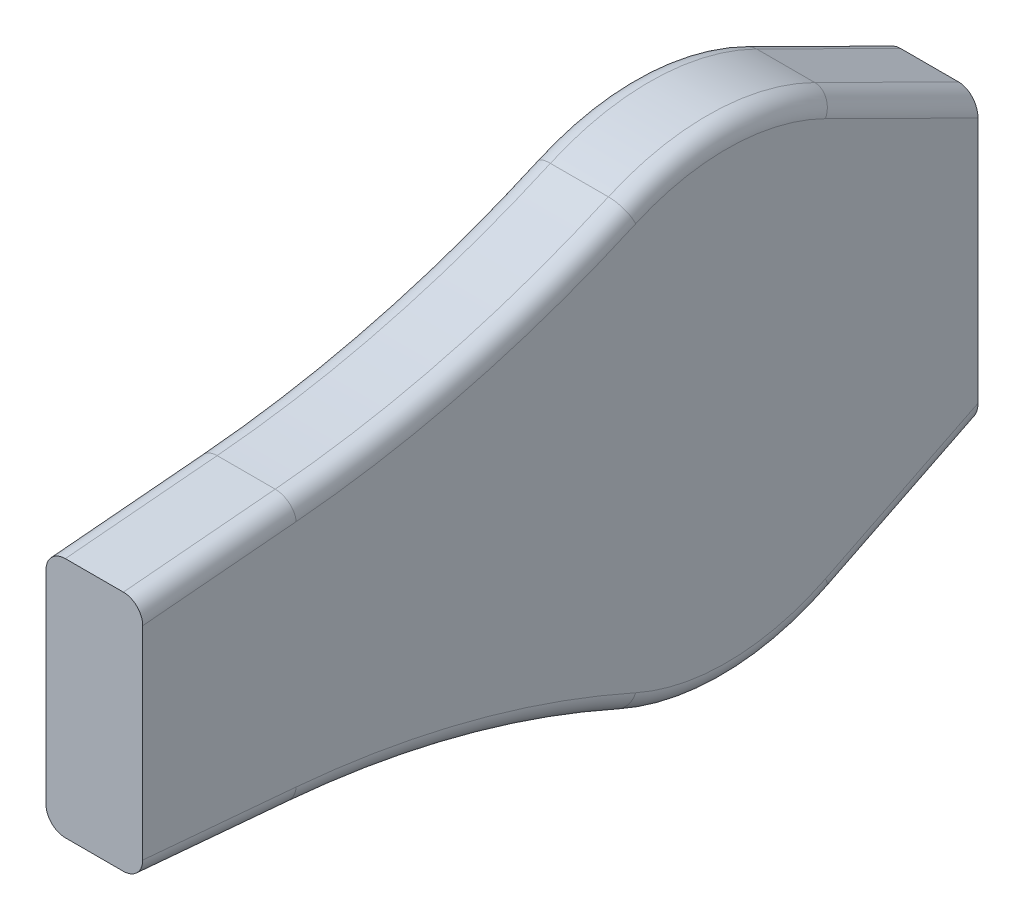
ISO-10303-21;
HEADER;
FILE_DESCRIPTION(('STEP AP214'),'2;1');
FILE_NAME('part.step','',(''),(''),'','','');
FILE_SCHEMA(('AUTOMOTIVE_DESIGN { 1 0 10303 214 1 1 1 1 }'));
ENDSEC;
DATA;
#1=APPLICATION_CONTEXT('core data for automotive mechanical design processes');
#2=APPLICATION_PROTOCOL_DEFINITION('international standard','automotive_design',2000,#1);
#3=PRODUCT_CONTEXT('',#1,'mechanical');
#4=PRODUCT('Part','Part','',(#3));
#5=PRODUCT_RELATED_PRODUCT_CATEGORY('part','',(#4));
#6=PRODUCT_DEFINITION_FORMATION('','',#4);
#7=PRODUCT_DEFINITION_CONTEXT('part definition',#1,'design');
#8=PRODUCT_DEFINITION('design','',#6,#7);
#9=PRODUCT_DEFINITION_SHAPE('','',#8);
#10=(LENGTH_UNIT() NAMED_UNIT(*) SI_UNIT(.MILLI.,.METRE.));
#11=(NAMED_UNIT(*) PLANE_ANGLE_UNIT() SI_UNIT($,.RADIAN.));
#12=(NAMED_UNIT(*) SI_UNIT($,.STERADIAN.) SOLID_ANGLE_UNIT());
#13=UNCERTAINTY_MEASURE_WITH_UNIT(LENGTH_MEASURE(1.E-05),#10,'distance_accuracy_value','');
#14=(GEOMETRIC_REPRESENTATION_CONTEXT(3) GLOBAL_UNCERTAINTY_ASSIGNED_CONTEXT((#13)) GLOBAL_UNIT_ASSIGNED_CONTEXT((#10,
#11,#12)) REPRESENTATION_CONTEXT('',''));
#15=CARTESIAN_POINT('',(0.,0.,0.));
#16=DIRECTION('',(0.,0.,1.));
#17=DIRECTION('',(1.,0.,0.));
#18=AXIS2_PLACEMENT_3D('',#15,#16,#17);
#19=CARTESIAN_POINT('',(1.,6.25,30.18));
#20=DIRECTION('',(0.,-0.996194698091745,-0.087155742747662));
#21=DIRECTION('',(0.,0.087155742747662,-0.996194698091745));
#22=AXIS2_PLACEMENT_3D('',#19,#20,#21);
#23=PLANE('',#22);
#24=DIRECTION('',(-1.,0.,0.));
#25=VECTOR('',#24,1.);
#26=CARTESIAN_POINT('',(1.,6.93667336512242,22.331287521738));
#27=LINE('',#26,#25);
#28=CARTESIAN_POINT('',(0.,6.93667336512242,22.331287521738));
#29=VERTEX_POINT('',#28);
#30=CARTESIAN_POINT('',(-3.,6.93667336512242,22.331287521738));
#31=VERTEX_POINT('',#30);
#32=EDGE_CURVE('E378',#29,#31,#27,.T.);
#33=ORIENTED_EDGE('',*,*,#32,.T.);
#34=DIRECTION('',(0.,-0.087155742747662,0.996194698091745));
#35=VECTOR('',#34,1.);
#36=CARTESIAN_POINT('',(-3.,6.25,30.18));
#37=LINE('',#36,#35);
#38=CARTESIAN_POINT('',(-3.,6.25,30.18));
#39=VERTEX_POINT('',#38);
#40=EDGE_CURVE('E11',#31,#39,#37,.T.);
#41=ORIENTED_EDGE('',*,*,#40,.T.);
#42=DIRECTION('',(-1.,0.,0.));
#43=VECTOR('',#42,1.);
#44=CARTESIAN_POINT('',(1.,6.25,30.18));
#45=LINE('',#44,#43);
#46=CARTESIAN_POINT('',(0.,6.25,30.18));
#47=VERTEX_POINT('',#46);
#48=EDGE_CURVE('E198',#47,#39,#45,.T.);
#49=ORIENTED_EDGE('',*,*,#48,.F.);
#50=DIRECTION('',(0.,-0.087155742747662,0.996194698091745));
#51=VECTOR('',#50,1.);
#52=CARTESIAN_POINT('',(0.,6.25,30.18));
#53=LINE('',#52,#51);
#54=EDGE_CURVE('E55',#47,#29,#53,.F.);
#55=ORIENTED_EDGE('',*,*,#54,.T.);
#56=EDGE_LOOP('',(#33,#41,#49,#55));
#57=FACE_BOUND('',#56,.T.);
#58=ADVANCED_FACE('F45',(#57),#23,.F.);
#59=CARTESIAN_POINT('',(1.,6.25,30.18));
#60=DIRECTION('',(0.,0.,-1.));
#61=DIRECTION('',(-1.,0.,0.));
#62=AXIS2_PLACEMENT_3D('',#59,#60,#61);
#63=PLANE('',#62);
#64=DIRECTION('',(0.,-1.,0.));
#65=VECTOR('',#64,1.);
#66=CARTESIAN_POINT('',(-4.,6.25,30.18));
#67=LINE('',#66,#65);
#68=CARTESIAN_POINT('',(-4.,5.24618016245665,30.18));
#69=VERTEX_POINT('',#68);
#70=CARTESIAN_POINT('',(-4.,-5.24618016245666,30.18));
#71=VERTEX_POINT('',#70);
#72=EDGE_CURVE('E354',#69,#71,#67,.T.);
#73=ORIENTED_EDGE('',*,*,#72,.T.);
#74=CARTESIAN_POINT('',(-3.,-5.24618016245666,30.18));
#75=DIRECTION('',(0.,0.,-1.));
#76=DIRECTION('',(0.,1.,0.));
#77=AXIS2_PLACEMENT_3D('',#74,#75,#76);
#78=ELLIPSE('',#77,1.00381983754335,1.);
#79=CARTESIAN_POINT('',(-3.,-6.25,30.18));
#80=VERTEX_POINT('',#79);
#81=EDGE_CURVE('E338',#71,#80,#78,.F.);
#82=ORIENTED_EDGE('',*,*,#81,.T.);
#83=DIRECTION('',(-1.,0.,0.));
#84=VECTOR('',#83,1.);
#85=CARTESIAN_POINT('',(1.,-6.25,30.18));
#86=LINE('',#85,#84);
#87=CARTESIAN_POINT('',(0.,-6.25,30.18));
#88=VERTEX_POINT('',#87);
#89=EDGE_CURVE('E401',#88,#80,#86,.T.);
#90=ORIENTED_EDGE('',*,*,#89,.F.);
#91=CARTESIAN_POINT('',(0.,-5.24618016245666,30.18));
#92=DIRECTION('',(0.,0.,-1.));
#93=DIRECTION('',(0.,-1.,0.));
#94=AXIS2_PLACEMENT_3D('',#91,#92,#93);
#95=ELLIPSE('',#94,1.00381983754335,1.);
#96=CARTESIAN_POINT('',(1.,-5.24618016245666,30.18));
#97=VERTEX_POINT('',#96);
#98=EDGE_CURVE('E335',#88,#97,#95,.F.);
#99=ORIENTED_EDGE('',*,*,#98,.T.);
#100=DIRECTION('',(0.,-1.,0.));
#101=VECTOR('',#100,1.);
#102=CARTESIAN_POINT('',(1.,6.25,30.18));
#103=LINE('',#102,#101);
#104=CARTESIAN_POINT('',(1.,5.24618016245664,30.18));
#105=VERTEX_POINT('',#104);
#106=EDGE_CURVE('E369',#105,#97,#103,.T.);
#107=ORIENTED_EDGE('',*,*,#106,.F.);
#108=CARTESIAN_POINT('',(0.,5.24618016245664,30.18));
#109=DIRECTION('',(0.,0.,-1.));
#110=DIRECTION('',(0.,-1.,0.));
#111=AXIS2_PLACEMENT_3D('',#108,#109,#110);
#112=ELLIPSE('',#111,1.00381983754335,1.);
#113=EDGE_CURVE('E68',#105,#47,#112,.F.);
#114=ORIENTED_EDGE('',*,*,#113,.T.);
#115=ORIENTED_EDGE('',*,*,#48,.T.);
#116=CARTESIAN_POINT('',(-3.,5.24618016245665,30.18));
#117=DIRECTION('',(0.,0.,-1.));
#118=DIRECTION('',(0.,1.,0.));
#119=AXIS2_PLACEMENT_3D('',#116,#117,#118);
#120=ELLIPSE('',#119,1.00381983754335,1.);
#121=EDGE_CURVE('E332',#39,#69,#120,.F.);
#122=ORIENTED_EDGE('',*,*,#121,.T.);
#123=EDGE_LOOP('',(#73,#82,#90,#99,#107,#114,#115,#122));
#124=FACE_BOUND('',#123,.T.);
#125=ADVANCED_FACE('F465',(#124),#63,.F.);
#126=CARTESIAN_POINT('',(1.,-6.25,30.18));
#127=DIRECTION('',(0.,0.996194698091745,-0.0871557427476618));
#128=DIRECTION('',(0.,0.0871557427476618,0.996194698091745));
#129=AXIS2_PLACEMENT_3D('',#126,#127,#128);
#130=PLANE('',#129);
#131=ORIENTED_EDGE('',*,*,#89,.T.);
#132=DIRECTION('',(0.,-0.0871557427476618,-0.996194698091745));
#133=VECTOR('',#132,1.);
#134=CARTESIAN_POINT('',(-3.,-6.93667336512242,22.331287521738));
#135=LINE('',#134,#133);
#136=CARTESIAN_POINT('',(-3.,-6.93667336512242,22.331287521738));
#137=VERTEX_POINT('',#136);
#138=EDGE_CURVE('E327',#80,#137,#135,.T.);
#139=ORIENTED_EDGE('',*,*,#138,.T.);
#140=DIRECTION('',(-1.,0.,0.));
#141=VECTOR('',#140,1.);
#142=CARTESIAN_POINT('',(1.,-6.93667336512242,22.331287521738));
#143=LINE('',#142,#141);
#144=CARTESIAN_POINT('',(0.,-6.93667336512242,22.331287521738));
#145=VERTEX_POINT('',#144);
#146=EDGE_CURVE('E397',#145,#137,#143,.T.);
#147=ORIENTED_EDGE('',*,*,#146,.F.);
#148=DIRECTION('',(0.,-0.0871557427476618,-0.996194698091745));
#149=VECTOR('',#148,1.);
#150=CARTESIAN_POINT('',(0.,-6.25,30.18));
#151=LINE('',#150,#149);
#152=EDGE_CURVE('E324',#145,#88,#151,.F.);
#153=ORIENTED_EDGE('',*,*,#152,.T.);
#154=EDGE_LOOP('',(#131,#139,#147,#153));
#155=FACE_BOUND('',#154,.T.);
#156=ADVANCED_FACE('F454',(#155),#130,.F.);
#157=CARTESIAN_POINT('',(1.,-60.3298263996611,27.0025831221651));
#158=DIRECTION('',(-1.,0.,0.));
#159=DIRECTION('',(0.,0.,1.));
#160=AXIS2_PLACEMENT_3D('',#157,#158,#159);
#161=CYLINDRICAL_SURFACE('',#160,53.5971062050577);
#162=ORIENTED_EDGE('',*,*,#146,.T.);
#163=CARTESIAN_POINT('',(-3.,-60.3298263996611,27.0025831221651));
#164=DIRECTION('',(-1.,0.,0.));
#165=DIRECTION('',(0.,0.,1.));
#166=AXIS2_PLACEMENT_3D('',#163,#164,#165);
#167=CIRCLE('',#166,53.5971062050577);
#168=CARTESIAN_POINT('',(-3.,-11.409316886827,5.10661220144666));
#169=VERTEX_POINT('',#168);
#170=EDGE_CURVE('E278',#137,#169,#167,.T.);
#171=ORIENTED_EDGE('',*,*,#170,.T.);
#172=DIRECTION('',(-1.,0.,0.));
#173=VECTOR('',#172,1.);
#174=CARTESIAN_POINT('',(1.,-11.409316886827,5.10661220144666));
#175=LINE('',#174,#173);
#176=CARTESIAN_POINT('',(0.,-11.409316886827,5.10661220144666));
#177=VERTEX_POINT('',#176);
#178=EDGE_CURVE('E209',#177,#169,#175,.T.);
#179=ORIENTED_EDGE('',*,*,#178,.F.);
#180=CARTESIAN_POINT('',(0.,-60.3298263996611,27.0025831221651));
#181=DIRECTION('',(-1.,0.,0.));
#182=DIRECTION('',(0.,0.,1.));
#183=AXIS2_PLACEMENT_3D('',#180,#181,#182);
#184=CIRCLE('',#183,53.5971062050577);
#185=EDGE_CURVE('E285',#177,#145,#184,.F.);
#186=ORIENTED_EDGE('',*,*,#185,.T.);
#187=EDGE_LOOP('',(#162,#171,#179,#186));
#188=FACE_BOUND('',#187,.T.);
#189=ADVANCED_FACE('F450',(#188),#161,.F.);
#190=CARTESIAN_POINT('',(1.,0.,0.));
#191=DIRECTION('',(-1.,0.,0.));
#192=DIRECTION('',(0.,0.,1.));
#193=AXIS2_PLACEMENT_3D('',#190,#191,#192);
#194=CYLINDRICAL_SURFACE('',#193,12.5);
#195=ORIENTED_EDGE('',*,*,#178,.T.);
#196=CARTESIAN_POINT('',(-3.,0.,0.));
#197=DIRECTION('',(-1.,0.,0.));
#198=DIRECTION('',(0.,0.,1.));
#199=AXIS2_PLACEMENT_3D('',#196,#197,#198);
#200=CIRCLE('',#199,12.5);
#201=CARTESIAN_POINT('',(-3.,-11.1951226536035,-5.56050616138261));
#202=VERTEX_POINT('',#201);
#203=EDGE_CURVE('E207',#169,#202,#200,.F.);
#204=ORIENTED_EDGE('',*,*,#203,.T.);
#205=DIRECTION('',(-1.,0.,0.));
#206=VECTOR('',#205,1.);
#207=CARTESIAN_POINT('',(1.,-11.1951226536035,-5.56050616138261));
#208=LINE('',#207,#206);
#209=CARTESIAN_POINT('',(0.,-11.1951226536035,-5.56050616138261));
#210=VERTEX_POINT('',#209);
#211=EDGE_CURVE('E190',#210,#202,#208,.T.);
#212=ORIENTED_EDGE('',*,*,#211,.F.);
#213=CARTESIAN_POINT('',(0.,0.,0.));
#214=DIRECTION('',(-1.,0.,0.));
#215=DIRECTION('',(0.,0.,1.));
#216=AXIS2_PLACEMENT_3D('',#213,#214,#215);
#217=CIRCLE('',#216,12.5);
#218=EDGE_CURVE('E204',#210,#177,#217,.T.);
#219=ORIENTED_EDGE('',*,*,#218,.T.);
#220=EDGE_LOOP('',(#195,#204,#212,#219));
#221=FACE_BOUND('',#220,.T.);
#222=ADVANCED_FACE('F203',(#221),#194,.T.);
#223=CARTESIAN_POINT('',(1.,-11.1951226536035,-5.56050616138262));
#224=DIRECTION('',(0.,0.895609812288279,0.444840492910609));
#225=DIRECTION('',(0.,-0.444840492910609,0.895609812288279));
#226=AXIS2_PLACEMENT_3D('',#223,#224,#225);
#227=PLANE('',#226);
#228=ORIENTED_EDGE('',*,*,#211,.T.);
#229=DIRECTION('',(0.,0.444840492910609,-0.895609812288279));
#230=VECTOR('',#229,1.);
#231=CARTESIAN_POINT('',(-3.,-7.5,-13.));
#232=LINE('',#231,#230);
#233=CARTESIAN_POINT('',(-3.,-7.5,-13.));
#234=VERTEX_POINT('',#233);
#235=EDGE_CURVE('E197',#202,#234,#232,.T.);
#236=ORIENTED_EDGE('',*,*,#235,.T.);
#237=DIRECTION('',(-1.,0.,0.));
#238=VECTOR('',#237,1.);
#239=CARTESIAN_POINT('',(1.,-7.5,-13.));
#240=LINE('',#239,#238);
#241=CARTESIAN_POINT('',(0.,-7.5,-13.));
#242=VERTEX_POINT('',#241);
#243=EDGE_CURVE('E193',#242,#234,#240,.T.);
#244=ORIENTED_EDGE('',*,*,#243,.F.);
#245=DIRECTION('',(0.,0.444840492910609,-0.895609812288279));
#246=VECTOR('',#245,1.);
#247=CARTESIAN_POINT('',(0.,-11.1951226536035,-5.56050616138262));
#248=LINE('',#247,#246);
#249=EDGE_CURVE('E186',#242,#210,#248,.F.);
#250=ORIENTED_EDGE('',*,*,#249,.T.);
#251=EDGE_LOOP('',(#228,#236,#244,#250));
#252=FACE_BOUND('',#251,.T.);
#253=ADVANCED_FACE('F188',(#252),#227,.F.);
#254=CARTESIAN_POINT('',(1.,7.5,-13.));
#255=DIRECTION('',(0.,0.,1.));
#256=DIRECTION('',(0.,-1.,0.));
#257=AXIS2_PLACEMENT_3D('',#254,#255,#256);
#258=PLANE('',#257);
#259=ORIENTED_EDGE('',*,*,#243,.T.);
#260=CARTESIAN_POINT('',(-3.,-6.38344233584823,-13.));
#261=DIRECTION('',(0.,0.,1.));
#262=DIRECTION('',(0.,-1.,0.));
#263=AXIS2_PLACEMENT_3D('',#260,#261,#262);
#264=ELLIPSE('',#263,1.11655766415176,1.);
#265=CARTESIAN_POINT('',(-4.,-6.38344233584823,-13.));
#266=VERTEX_POINT('',#265);
#267=EDGE_CURVE('E418',#234,#266,#264,.F.);
#268=ORIENTED_EDGE('',*,*,#267,.T.);
#269=DIRECTION('',(0.,1.,0.));
#270=VECTOR('',#269,1.);
#271=CARTESIAN_POINT('',(-4.,7.5,-13.));
#272=LINE('',#271,#270);
#273=CARTESIAN_POINT('',(-4.,6.38344233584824,-13.));
#274=VERTEX_POINT('',#273);
#275=EDGE_CURVE('E362',#266,#274,#272,.T.);
#276=ORIENTED_EDGE('',*,*,#275,.T.);
#277=CARTESIAN_POINT('',(-3.,6.38344233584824,-13.));
#278=DIRECTION('',(0.,0.,1.));
#279=DIRECTION('',(0.,-1.,0.));
#280=AXIS2_PLACEMENT_3D('',#277,#278,#279);
#281=ELLIPSE('',#280,1.11655766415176,1.);
#282=CARTESIAN_POINT('',(-3.,7.5,-13.));
#283=VERTEX_POINT('',#282);
#284=EDGE_CURVE('E412',#274,#283,#281,.F.);
#285=ORIENTED_EDGE('',*,*,#284,.T.);
#286=DIRECTION('',(-1.,0.,0.));
#287=VECTOR('',#286,1.);
#288=CARTESIAN_POINT('',(1.,7.5,-13.));
#289=LINE('',#288,#287);
#290=CARTESIAN_POINT('',(0.,7.5,-13.));
#291=VERTEX_POINT('',#290);
#292=EDGE_CURVE('E389',#291,#283,#289,.T.);
#293=ORIENTED_EDGE('',*,*,#292,.F.);
#294=CARTESIAN_POINT('',(0.,6.38344233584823,-13.));
#295=DIRECTION('',(0.,0.,1.));
#296=DIRECTION('',(0.,1.,0.));
#297=AXIS2_PLACEMENT_3D('',#294,#295,#296);
#298=ELLIPSE('',#297,1.11655766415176,1.);
#299=CARTESIAN_POINT('',(1.,6.38344233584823,-13.));
#300=VERTEX_POINT('',#299);
#301=EDGE_CURVE('E409',#291,#300,#298,.F.);
#302=ORIENTED_EDGE('',*,*,#301,.T.);
#303=DIRECTION('',(0.,1.,0.));
#304=VECTOR('',#303,1.);
#305=CARTESIAN_POINT('',(1.,7.5,-13.));
#306=LINE('',#305,#304);
#307=CARTESIAN_POINT('',(1.,-6.38344233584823,-13.));
#308=VERTEX_POINT('',#307);
#309=EDGE_CURVE('E374',#308,#300,#306,.T.);
#310=ORIENTED_EDGE('',*,*,#309,.F.);
#311=CARTESIAN_POINT('',(0.,-6.38344233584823,-13.));
#312=DIRECTION('',(0.,0.,1.));
#313=DIRECTION('',(0.,1.,0.));
#314=AXIS2_PLACEMENT_3D('',#311,#312,#313);
#315=ELLIPSE('',#314,1.11655766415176,1.);
#316=EDGE_CURVE('E415',#308,#242,#315,.F.);
#317=ORIENTED_EDGE('',*,*,#316,.T.);
#318=EDGE_LOOP('',(#259,#268,#276,#285,#293,#302,#310,#317));
#319=FACE_BOUND('',#318,.T.);
#320=ADVANCED_FACE('F476',(#319),#258,.F.);
#321=CARTESIAN_POINT('',(1.,11.1951226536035,-5.56050616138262));
#322=DIRECTION('',(0.,-0.895609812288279,0.444840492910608));
#323=DIRECTION('',(0.,-0.444840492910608,-0.89560981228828));
#324=AXIS2_PLACEMENT_3D('',#321,#322,#323);
#325=PLANE('',#324);
#326=ORIENTED_EDGE('',*,*,#292,.T.);
#327=DIRECTION('',(0.,0.444840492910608,0.89560981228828));
#328=VECTOR('',#327,1.);
#329=CARTESIAN_POINT('',(-3.,11.1951226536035,-5.56050616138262));
#330=LINE('',#329,#328);
#331=CARTESIAN_POINT('',(-3.,11.1951226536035,-5.56050616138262));
#332=VERTEX_POINT('',#331);
#333=EDGE_CURVE('E309',#283,#332,#330,.T.);
#334=ORIENTED_EDGE('',*,*,#333,.T.);
#335=DIRECTION('',(-1.,0.,0.));
#336=VECTOR('',#335,1.);
#337=CARTESIAN_POINT('',(1.,11.1951226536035,-5.56050616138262));
#338=LINE('',#337,#336);
#339=CARTESIAN_POINT('',(0.,11.1951226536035,-5.56050616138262));
#340=VERTEX_POINT('',#339);
#341=EDGE_CURVE('E385',#340,#332,#338,.T.);
#342=ORIENTED_EDGE('',*,*,#341,.F.);
#343=DIRECTION('',(0.,0.444840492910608,0.89560981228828));
#344=VECTOR('',#343,1.);
#345=CARTESIAN_POINT('',(0.,11.1951226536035,-5.56050616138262));
#346=LINE('',#345,#344);
#347=EDGE_CURVE('E306',#340,#291,#346,.F.);
#348=ORIENTED_EDGE('',*,*,#347,.T.);
#349=EDGE_LOOP('',(#326,#334,#342,#348));
#350=FACE_BOUND('',#349,.T.);
#351=ADVANCED_FACE('F547',(#350),#325,.F.);
#352=CARTESIAN_POINT('',(1.,0.,0.));
#353=DIRECTION('',(-1.,0.,0.));
#354=DIRECTION('',(0.,0.,1.));
#355=AXIS2_PLACEMENT_3D('',#352,#353,#354);
#356=CYLINDRICAL_SURFACE('',#355,12.5);
#357=ORIENTED_EDGE('',*,*,#341,.T.);
#358=CARTESIAN_POINT('',(-3.,0.,0.));
#359=DIRECTION('',(-1.,0.,0.));
#360=DIRECTION('',(0.,0.,1.));
#361=AXIS2_PLACEMENT_3D('',#358,#359,#360);
#362=CIRCLE('',#361,12.5);
#363=CARTESIAN_POINT('',(-3.,11.409316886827,5.10661220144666));
#364=VERTEX_POINT('',#363);
#365=EDGE_CURVE('E316',#332,#364,#362,.F.);
#366=ORIENTED_EDGE('',*,*,#365,.T.);
#367=DIRECTION('',(-1.,0.,0.));
#368=VECTOR('',#367,1.);
#369=CARTESIAN_POINT('',(1.,11.409316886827,5.10661220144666));
#370=LINE('',#369,#368);
#371=CARTESIAN_POINT('',(0.,11.409316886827,5.10661220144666));
#372=VERTEX_POINT('',#371);
#373=EDGE_CURVE('E381',#372,#364,#370,.T.);
#374=ORIENTED_EDGE('',*,*,#373,.F.);
#375=CARTESIAN_POINT('',(0.,0.,0.));
#376=DIRECTION('',(-1.,0.,0.));
#377=DIRECTION('',(0.,0.,1.));
#378=AXIS2_PLACEMENT_3D('',#375,#376,#377);
#379=CIRCLE('',#378,12.5);
#380=EDGE_CURVE('E313',#372,#340,#379,.T.);
#381=ORIENTED_EDGE('',*,*,#380,.T.);
#382=EDGE_LOOP('',(#357,#366,#374,#381));
#383=FACE_BOUND('',#382,.T.);
#384=ADVANCED_FACE('F549',(#383),#356,.T.);
#385=CARTESIAN_POINT('',(1.,60.3298263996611,27.0025831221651));
#386=DIRECTION('',(-1.,0.,0.));
#387=DIRECTION('',(0.,0.,1.));
#388=AXIS2_PLACEMENT_3D('',#385,#386,#387);
#389=CYLINDRICAL_SURFACE('',#388,53.5971062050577);
#390=ORIENTED_EDGE('',*,*,#373,.T.);
#391=CARTESIAN_POINT('',(-3.,60.3298263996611,27.0025831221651));
#392=DIRECTION('',(-1.,0.,0.));
#393=DIRECTION('',(0.,0.,1.));
#394=AXIS2_PLACEMENT_3D('',#391,#392,#393);
#395=CIRCLE('',#394,53.5971062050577);
#396=EDGE_CURVE('E321',#364,#31,#395,.T.);
#397=ORIENTED_EDGE('',*,*,#396,.T.);
#398=ORIENTED_EDGE('',*,*,#32,.F.);
#399=CARTESIAN_POINT('',(0.,60.3298263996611,27.0025831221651));
#400=DIRECTION('',(-1.,0.,0.));
#401=DIRECTION('',(0.,0.,1.));
#402=AXIS2_PLACEMENT_3D('',#399,#400,#401);
#403=CIRCLE('',#402,53.5971062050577);
#404=EDGE_CURVE('E270',#29,#372,#403,.F.);
#405=ORIENTED_EDGE('',*,*,#404,.T.);
#406=EDGE_LOOP('',(#390,#397,#398,#405));
#407=FACE_BOUND('',#406,.T.);
#408=ADVANCED_FACE('F553',(#407),#389,.F.);
#409=CARTESIAN_POINT('',(1.,60.3298263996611,27.0025831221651));
#410=DIRECTION('',(-1.,0.,0.));
#411=DIRECTION('',(0.,0.,1.));
#412=AXIS2_PLACEMENT_3D('',#409,#410,#411);
#413=PLANE('',#412);
#414=CARTESIAN_POINT('',(1.,0.,0.));
#415=DIRECTION('',(-1.,0.,0.));
#416=DIRECTION('',(0.,0.,1.));
#417=AXIS2_PLACEMENT_3D('',#414,#415,#416);
#418=CIRCLE('',#417,11.5);
#419=CARTESIAN_POINT('',(1.,-10.4965715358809,4.69808322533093));
#420=VERTEX_POINT('',#419);
#421=CARTESIAN_POINT('',(1.,-10.2995128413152,-5.115665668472));
#422=VERTEX_POINT('',#421);
#423=EDGE_CURVE('E301',#420,#422,#418,.F.);
#424=ORIENTED_EDGE('',*,*,#423,.T.);
#425=DIRECTION('',(0.,0.444840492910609,-0.895609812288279));
#426=VECTOR('',#425,1.);
#427=CARTESIAN_POINT('',(1.,-9.11918583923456,-7.49205105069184));
#428=LINE('',#427,#426);
#429=EDGE_CURVE('E225',#422,#308,#428,.T.);
#430=ORIENTED_EDGE('',*,*,#429,.T.);
#431=ORIENTED_EDGE('',*,*,#309,.T.);
#432=DIRECTION('',(0.,0.444840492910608,0.89560981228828));
#433=VECTOR('',#432,1.);
#434=CARTESIAN_POINT('',(1.,32.9956876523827,40.5791781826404));
#435=LINE('',#434,#433);
#436=CARTESIAN_POINT('',(1.,10.2995128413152,-5.11566566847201));
#437=VERTEX_POINT('',#436);
#438=EDGE_CURVE('E291',#300,#437,#435,.T.);
#439=ORIENTED_EDGE('',*,*,#438,.T.);
#440=CARTESIAN_POINT('',(1.,0.,0.));
#441=DIRECTION('',(-1.,0.,0.));
#442=DIRECTION('',(0.,0.,1.));
#443=AXIS2_PLACEMENT_3D('',#440,#441,#442);
#444=CIRCLE('',#443,11.5);
#445=CARTESIAN_POINT('',(1.,10.4965715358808,4.69808322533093));
#446=VERTEX_POINT('',#445);
#447=EDGE_CURVE('E283',#437,#446,#444,.F.);
#448=ORIENTED_EDGE('',*,*,#447,.T.);
#449=CARTESIAN_POINT('',(1.,60.3298263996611,27.0025831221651));
#450=DIRECTION('',(-1.,0.,0.));
#451=DIRECTION('',(0.,0.,1.));
#452=AXIS2_PLACEMENT_3D('',#449,#450,#451);
#453=CIRCLE('',#452,54.5971062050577);
#454=CARTESIAN_POINT('',(1.,5.94047866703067,22.2441317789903));
#455=VERTEX_POINT('',#454);
#456=EDGE_CURVE('E269',#446,#455,#453,.T.);
#457=ORIENTED_EDGE('',*,*,#456,.T.);
#458=DIRECTION('',(0.,-0.087155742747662,0.996194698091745));
#459=VECTOR('',#458,1.);
#460=CARTESIAN_POINT('',(1.,5.94047866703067,22.2441317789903));
#461=LINE('',#460,#459);
#462=EDGE_CURVE('E274',#455,#105,#461,.T.);
#463=ORIENTED_EDGE('',*,*,#462,.T.);
#464=ORIENTED_EDGE('',*,*,#106,.T.);
#465=DIRECTION('',(0.,-0.0871557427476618,-0.996194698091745));
#466=VECTOR('',#465,1.);
#467=CARTESIAN_POINT('',(1.,-5.02393304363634,32.7202961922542));
#468=LINE('',#467,#466);
#469=CARTESIAN_POINT('',(1.,-5.94047866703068,22.2441317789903));
#470=VERTEX_POINT('',#469);
#471=EDGE_CURVE('E295',#97,#470,#468,.T.);
#472=ORIENTED_EDGE('',*,*,#471,.T.);
#473=CARTESIAN_POINT('',(1.,-60.3298263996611,27.0025831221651));
#474=DIRECTION('',(-1.,0.,0.));
#475=DIRECTION('',(0.,0.,1.));
#476=AXIS2_PLACEMENT_3D('',#473,#474,#475);
#477=CIRCLE('',#476,54.5971062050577);
#478=EDGE_CURVE('E298',#470,#420,#477,.T.);
#479=ORIENTED_EDGE('',*,*,#478,.T.);
#480=EDGE_LOOP('',(#424,#430,#431,#439,#448,#457,#463,#464,#472,#479));
#481=FACE_BOUND('',#480,.T.);
#482=ADVANCED_FACE('F464',(#481),#413,.F.);
#483=CARTESIAN_POINT('',(-4.,60.3298263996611,27.0025831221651));
#484=DIRECTION('',(-1.,0.,0.));
#485=DIRECTION('',(0.,0.,1.));
#486=AXIS2_PLACEMENT_3D('',#483,#484,#485);
#487=PLANE('',#486);
#488=ORIENTED_EDGE('',*,*,#275,.F.);
#489=DIRECTION('',(0.,0.444840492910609,-0.895609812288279));
#490=VECTOR('',#489,1.);
#491=CARTESIAN_POINT('',(-4.,-10.2995128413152,-5.115665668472));
#492=LINE('',#491,#490);
#493=CARTESIAN_POINT('',(-4.,-10.2995128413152,-5.115665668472));
#494=VERTEX_POINT('',#493);
#495=EDGE_CURVE('E221',#266,#494,#492,.F.);
#496=ORIENTED_EDGE('',*,*,#495,.T.);
#497=CARTESIAN_POINT('',(-4.,0.,0.));
#498=DIRECTION('',(-1.,0.,0.));
#499=DIRECTION('',(0.,0.,1.));
#500=AXIS2_PLACEMENT_3D('',#497,#498,#499);
#501=CIRCLE('',#500,11.5);
#502=CARTESIAN_POINT('',(-4.,-10.4965715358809,4.69808322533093));
#503=VERTEX_POINT('',#502);
#504=EDGE_CURVE('E439',#494,#503,#501,.T.);
#505=ORIENTED_EDGE('',*,*,#504,.T.);
#506=CARTESIAN_POINT('',(-4.,-60.3298263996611,27.0025831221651));
#507=DIRECTION('',(-1.,0.,0.));
#508=DIRECTION('',(0.,0.,1.));
#509=AXIS2_PLACEMENT_3D('',#506,#507,#508);
#510=CIRCLE('',#509,54.5971062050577);
#511=CARTESIAN_POINT('',(-4.,-5.94047866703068,22.2441317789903));
#512=VERTEX_POINT('',#511);
#513=EDGE_CURVE('E436',#503,#512,#510,.F.);
#514=ORIENTED_EDGE('',*,*,#513,.T.);
#515=DIRECTION('',(0.,-0.0871557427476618,-0.996194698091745));
#516=VECTOR('',#515,1.);
#517=CARTESIAN_POINT('',(-4.,-5.25380530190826,30.0928442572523));
#518=LINE('',#517,#516);
#519=EDGE_CURVE('E433',#512,#71,#518,.F.);
#520=ORIENTED_EDGE('',*,*,#519,.T.);
#521=ORIENTED_EDGE('',*,*,#72,.F.);
#522=DIRECTION('',(0.,-0.087155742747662,0.996194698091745));
#523=VECTOR('',#522,1.);
#524=CARTESIAN_POINT('',(-4.,5.94047866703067,22.2441317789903));
#525=LINE('',#524,#523);
#526=CARTESIAN_POINT('',(-4.,5.94047866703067,22.2441317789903));
#527=VERTEX_POINT('',#526);
#528=EDGE_CURVE('E421',#69,#527,#525,.F.);
#529=ORIENTED_EDGE('',*,*,#528,.T.);
#530=CARTESIAN_POINT('',(-4.,60.3298263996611,27.0025831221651));
#531=DIRECTION('',(-1.,0.,0.));
#532=DIRECTION('',(0.,0.,1.));
#533=AXIS2_PLACEMENT_3D('',#530,#531,#532);
#534=CIRCLE('',#533,54.5971062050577);
#535=CARTESIAN_POINT('',(-4.,10.4965715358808,4.69808322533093));
#536=VERTEX_POINT('',#535);
#537=EDGE_CURVE('E424',#527,#536,#534,.F.);
#538=ORIENTED_EDGE('',*,*,#537,.T.);
#539=CARTESIAN_POINT('',(-4.,0.,0.));
#540=DIRECTION('',(-1.,0.,0.));
#541=DIRECTION('',(0.,0.,1.));
#542=AXIS2_PLACEMENT_3D('',#539,#540,#541);
#543=CIRCLE('',#542,11.5);
#544=CARTESIAN_POINT('',(-4.,10.2995128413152,-5.11566566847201));
#545=VERTEX_POINT('',#544);
#546=EDGE_CURVE('E427',#536,#545,#543,.T.);
#547=ORIENTED_EDGE('',*,*,#546,.T.);
#548=DIRECTION('',(0.,0.444840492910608,0.89560981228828));
#549=VECTOR('',#548,1.);
#550=CARTESIAN_POINT('',(-4.,6.60439018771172,-12.5551595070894));
#551=LINE('',#550,#549);
#552=EDGE_CURVE('E430',#545,#274,#551,.F.);
#553=ORIENTED_EDGE('',*,*,#552,.T.);
#554=EDGE_LOOP('',(#488,#496,#505,#514,#520,#521,#529,#538,#547,#553));
#555=FACE_BOUND('',#554,.T.);
#556=ADVANCED_FACE('F509',(#555),#487,.T.);
#557=CARTESIAN_POINT('',(-3.,-5.25380530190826,30.0928442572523));
#558=DIRECTION('',(0.,0.0871557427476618,0.996194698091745));
#559=DIRECTION('',(0.,-0.996194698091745,0.0871557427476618));
#560=AXIS2_PLACEMENT_3D('',#557,#558,#559);
#561=CYLINDRICAL_SURFACE('',#560,1.);
#562=ORIENTED_EDGE('',*,*,#81,.F.);
#563=ORIENTED_EDGE('',*,*,#519,.F.);
#564=CARTESIAN_POINT('',(-3.,-5.94047866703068,22.2441317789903));
#565=DIRECTION('',(0.,-0.0871557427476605,-0.996194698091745));
#566=DIRECTION('',(0.,0.996194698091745,-0.0871557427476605));
#567=AXIS2_PLACEMENT_3D('',#564,#565,#566);
#568=CIRCLE('',#567,1.);
#569=EDGE_CURVE('E238',#137,#512,#568,.T.);
#570=ORIENTED_EDGE('',*,*,#569,.F.);
#571=ORIENTED_EDGE('',*,*,#138,.F.);
#572=EDGE_LOOP('',(#562,#563,#570,#571));
#573=FACE_BOUND('',#572,.T.);
#574=ADVANCED_FACE('F467',(#573),#561,.T.);
#575=CARTESIAN_POINT('',(-3.,-60.3298263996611,27.0025831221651));
#576=DIRECTION('',(-1.,0.,0.));
#577=DIRECTION('',(0.,0.,1.));
#578=AXIS2_PLACEMENT_3D('',#575,#576,#577);
#579=TOROIDAL_SURFACE('',#578,54.5971062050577,1.);
#580=ORIENTED_EDGE('',*,*,#569,.T.);
#581=ORIENTED_EDGE('',*,*,#513,.F.);
#582=CARTESIAN_POINT('',(-3.,-10.4965715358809,4.69808322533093));
#583=DIRECTION('',(0.,-0.408528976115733,-0.912745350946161));
#584=DIRECTION('',(0.,0.912745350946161,-0.408528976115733));
#585=AXIS2_PLACEMENT_3D('',#582,#583,#584);
#586=CIRCLE('',#585,1.);
#587=EDGE_CURVE('E345',#169,#503,#586,.T.);
#588=ORIENTED_EDGE('',*,*,#587,.F.);
#589=ORIENTED_EDGE('',*,*,#170,.F.);
#590=EDGE_LOOP('',(#580,#581,#588,#589));
#591=FACE_BOUND('',#590,.T.);
#592=ADVANCED_FACE('F469',(#591),#579,.T.);
#593=CARTESIAN_POINT('',(-3.,0.,0.));
#594=DIRECTION('',(-1.,0.,0.));
#595=DIRECTION('',(0.,0.,1.));
#596=AXIS2_PLACEMENT_3D('',#593,#594,#595);
#597=TOROIDAL_SURFACE('',#596,11.5,1.);
#598=ORIENTED_EDGE('',*,*,#587,.T.);
#599=ORIENTED_EDGE('',*,*,#504,.F.);
#600=CARTESIAN_POINT('',(-3.,-10.2995128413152,-5.115665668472));
#601=DIRECTION('',(0.,0.444840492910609,-0.895609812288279));
#602=DIRECTION('',(0.,0.895609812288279,0.444840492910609));
#603=AXIS2_PLACEMENT_3D('',#600,#601,#602);
#604=CIRCLE('',#603,1.);
#605=EDGE_CURVE('E244',#202,#494,#604,.T.);
#606=ORIENTED_EDGE('',*,*,#605,.F.);
#607=ORIENTED_EDGE('',*,*,#203,.F.);
#608=EDGE_LOOP('',(#598,#599,#606,#607));
#609=FACE_BOUND('',#608,.T.);
#610=ADVANCED_FACE('F470',(#609),#597,.T.);
#611=CARTESIAN_POINT('',(-3.,-10.2995128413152,-5.11566566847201));
#612=DIRECTION('',(0.,-0.444840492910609,0.895609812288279));
#613=DIRECTION('',(0.,-0.895609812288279,-0.444840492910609));
#614=AXIS2_PLACEMENT_3D('',#611,#612,#613);
#615=CYLINDRICAL_SURFACE('',#614,1.);
#616=ORIENTED_EDGE('',*,*,#605,.T.);
#617=ORIENTED_EDGE('',*,*,#495,.F.);
#618=ORIENTED_EDGE('',*,*,#267,.F.);
#619=ORIENTED_EDGE('',*,*,#235,.F.);
#620=EDGE_LOOP('',(#616,#617,#618,#619));
#621=FACE_BOUND('',#620,.T.);
#622=ADVANCED_FACE('F474',(#621),#615,.T.);
#623=CARTESIAN_POINT('',(0.,-5.02393304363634,32.7202961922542));
#624=DIRECTION('',(0.,-0.0871557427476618,-0.996194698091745));
#625=DIRECTION('',(0.,0.996194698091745,-0.0871557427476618));
#626=AXIS2_PLACEMENT_3D('',#623,#624,#625);
#627=CYLINDRICAL_SURFACE('',#626,1.);
#628=ORIENTED_EDGE('',*,*,#98,.F.);
#629=ORIENTED_EDGE('',*,*,#152,.F.);
#630=CARTESIAN_POINT('',(0.,-5.94047866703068,22.2441317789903));
#631=DIRECTION('',(0.,-0.0871557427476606,-0.996194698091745));
#632=DIRECTION('',(0.,0.996194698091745,-0.0871557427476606));
#633=AXIS2_PLACEMENT_3D('',#630,#631,#632);
#634=CIRCLE('',#633,1.);
#635=EDGE_CURVE('E232',#470,#145,#634,.T.);
#636=ORIENTED_EDGE('',*,*,#635,.F.);
#637=ORIENTED_EDGE('',*,*,#471,.F.);
#638=EDGE_LOOP('',(#628,#629,#636,#637));
#639=FACE_BOUND('',#638,.T.);
#640=ADVANCED_FACE('F460',(#639),#627,.T.);
#641=CARTESIAN_POINT('',(0.,-60.3298263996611,27.0025831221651));
#642=DIRECTION('',(-1.,0.,0.));
#643=DIRECTION('',(0.,0.,1.));
#644=AXIS2_PLACEMENT_3D('',#641,#642,#643);
#645=TOROIDAL_SURFACE('',#644,54.5971062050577,1.);
#646=ORIENTED_EDGE('',*,*,#635,.T.);
#647=ORIENTED_EDGE('',*,*,#185,.F.);
#648=CARTESIAN_POINT('',(0.,-10.4965715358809,4.69808322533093));
#649=DIRECTION('',(0.,-0.408528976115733,-0.912745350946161));
#650=DIRECTION('',(0.,0.912745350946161,-0.408528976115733));
#651=AXIS2_PLACEMENT_3D('',#648,#649,#650);
#652=CIRCLE('',#651,1.);
#653=EDGE_CURVE('E219',#420,#177,#652,.T.);
#654=ORIENTED_EDGE('',*,*,#653,.F.);
#655=ORIENTED_EDGE('',*,*,#478,.F.);
#656=EDGE_LOOP('',(#646,#647,#654,#655));
#657=FACE_BOUND('',#656,.T.);
#658=ADVANCED_FACE('F463',(#657),#645,.T.);
#659=CARTESIAN_POINT('',(0.,0.,0.));
#660=DIRECTION('',(-1.,0.,0.));
#661=DIRECTION('',(0.,0.,1.));
#662=AXIS2_PLACEMENT_3D('',#659,#660,#661);
#663=TOROIDAL_SURFACE('',#662,11.5,1.);
#664=ORIENTED_EDGE('',*,*,#653,.T.);
#665=ORIENTED_EDGE('',*,*,#218,.F.);
#666=CARTESIAN_POINT('',(0.,-10.2995128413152,-5.115665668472));
#667=DIRECTION('',(0.,0.444840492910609,-0.895609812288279));
#668=DIRECTION('',(0.,0.895609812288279,0.444840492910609));
#669=AXIS2_PLACEMENT_3D('',#666,#667,#668);
#670=CIRCLE('',#669,1.);
#671=EDGE_CURVE('E216',#422,#210,#670,.T.);
#672=ORIENTED_EDGE('',*,*,#671,.F.);
#673=ORIENTED_EDGE('',*,*,#423,.F.);
#674=EDGE_LOOP('',(#664,#665,#672,#673));
#675=FACE_BOUND('',#674,.T.);
#676=ADVANCED_FACE('F214',(#675),#663,.T.);
#677=CARTESIAN_POINT('',(0.,-9.11918583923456,-7.49205105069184));
#678=DIRECTION('',(0.,0.444840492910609,-0.895609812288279));
#679=DIRECTION('',(0.,0.895609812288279,0.444840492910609));
#680=AXIS2_PLACEMENT_3D('',#677,#678,#679);
#681=CYLINDRICAL_SURFACE('',#680,1.);
#682=ORIENTED_EDGE('',*,*,#671,.T.);
#683=ORIENTED_EDGE('',*,*,#249,.F.);
#684=ORIENTED_EDGE('',*,*,#316,.F.);
#685=ORIENTED_EDGE('',*,*,#429,.F.);
#686=EDGE_LOOP('',(#682,#683,#684,#685));
#687=FACE_BOUND('',#686,.T.);
#688=ADVANCED_FACE('F223',(#687),#681,.T.);
#689=CARTESIAN_POINT('',(-3.,5.25380530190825,30.0928442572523));
#690=DIRECTION('',(0.,0.087155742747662,-0.996194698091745));
#691=DIRECTION('',(0.,0.996194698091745,0.087155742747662));
#692=AXIS2_PLACEMENT_3D('',#689,#690,#691);
#693=CYLINDRICAL_SURFACE('',#692,1.);
#694=ORIENTED_EDGE('',*,*,#121,.F.);
#695=ORIENTED_EDGE('',*,*,#40,.F.);
#696=CARTESIAN_POINT('',(-3.,5.94047866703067,22.2441317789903));
#697=DIRECTION('',(0.,0.0871557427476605,-0.996194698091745));
#698=DIRECTION('',(0.,0.996194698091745,0.0871557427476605));
#699=AXIS2_PLACEMENT_3D('',#696,#697,#698);
#700=CIRCLE('',#699,1.);
#701=EDGE_CURVE('E227',#527,#31,#700,.T.);
#702=ORIENTED_EDGE('',*,*,#701,.F.);
#703=ORIENTED_EDGE('',*,*,#528,.F.);
#704=EDGE_LOOP('',(#694,#695,#702,#703));
#705=FACE_BOUND('',#704,.T.);
#706=ADVANCED_FACE('F512',(#705),#693,.T.);
#707=CARTESIAN_POINT('',(-3.,60.3298263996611,27.0025831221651));
#708=DIRECTION('',(-1.,0.,0.));
#709=DIRECTION('',(0.,0.,1.));
#710=AXIS2_PLACEMENT_3D('',#707,#708,#709);
#711=TOROIDAL_SURFACE('',#710,54.5971062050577,1.);
#712=ORIENTED_EDGE('',*,*,#701,.T.);
#713=ORIENTED_EDGE('',*,*,#396,.F.);
#714=CARTESIAN_POINT('',(-3.,10.4965715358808,4.69808322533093));
#715=DIRECTION('',(0.,0.408528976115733,-0.912745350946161));
#716=DIRECTION('',(0.,0.912745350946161,0.408528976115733));
#717=AXIS2_PLACEMENT_3D('',#714,#715,#716);
#718=CIRCLE('',#717,1.);
#719=EDGE_CURVE('E235',#536,#364,#718,.T.);
#720=ORIENTED_EDGE('',*,*,#719,.F.);
#721=ORIENTED_EDGE('',*,*,#537,.F.);
#722=EDGE_LOOP('',(#712,#713,#720,#721));
#723=FACE_BOUND('',#722,.T.);
#724=ADVANCED_FACE('F526',(#723),#711,.T.);
#725=CARTESIAN_POINT('',(-3.,0.,0.));
#726=DIRECTION('',(-1.,0.,0.));
#727=DIRECTION('',(0.,0.,1.));
#728=AXIS2_PLACEMENT_3D('',#725,#726,#727);
#729=TOROIDAL_SURFACE('',#728,11.5,1.);
#730=ORIENTED_EDGE('',*,*,#719,.T.);
#731=ORIENTED_EDGE('',*,*,#365,.F.);
#732=CARTESIAN_POINT('',(-3.,10.2995128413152,-5.11566566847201));
#733=DIRECTION('',(0.,-0.444840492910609,-0.895609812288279));
#734=DIRECTION('',(0.,0.895609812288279,-0.444840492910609));
#735=AXIS2_PLACEMENT_3D('',#732,#733,#734);
#736=CIRCLE('',#735,1.);
#737=EDGE_CURVE('E245',#545,#332,#736,.T.);
#738=ORIENTED_EDGE('',*,*,#737,.F.);
#739=ORIENTED_EDGE('',*,*,#546,.F.);
#740=EDGE_LOOP('',(#730,#731,#738,#739));
#741=FACE_BOUND('',#740,.T.);
#742=ADVANCED_FACE('F522',(#741),#729,.T.);
#743=CARTESIAN_POINT('',(-3.,10.2995128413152,-5.11566566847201));
#744=DIRECTION('',(0.,-0.444840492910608,-0.89560981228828));
#745=DIRECTION('',(0.,0.895609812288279,-0.444840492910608));
#746=AXIS2_PLACEMENT_3D('',#743,#744,#745);
#747=CYLINDRICAL_SURFACE('',#746,1.);
#748=ORIENTED_EDGE('',*,*,#284,.F.);
#749=ORIENTED_EDGE('',*,*,#552,.F.);
#750=ORIENTED_EDGE('',*,*,#737,.T.);
#751=ORIENTED_EDGE('',*,*,#333,.F.);
#752=EDGE_LOOP('',(#748,#749,#750,#751));
#753=FACE_BOUND('',#752,.T.);
#754=ADVANCED_FACE('F519',(#753),#747,.T.);
#755=CARTESIAN_POINT('',(0.,5.94047866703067,22.2441317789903));
#756=DIRECTION('',(0.,-0.087155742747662,0.996194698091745));
#757=DIRECTION('',(0.,-0.996194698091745,-0.087155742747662));
#758=AXIS2_PLACEMENT_3D('',#755,#756,#757);
#759=CYLINDRICAL_SURFACE('',#758,1.);
#760=ORIENTED_EDGE('',*,*,#113,.F.);
#761=ORIENTED_EDGE('',*,*,#462,.F.);
#762=CARTESIAN_POINT('',(0.,5.94047866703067,22.2441317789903));
#763=DIRECTION('',(0.,0.0871557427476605,-0.996194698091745));
#764=DIRECTION('',(0.,0.996194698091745,0.0871557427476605));
#765=AXIS2_PLACEMENT_3D('',#762,#763,#764);
#766=CIRCLE('',#765,1.);
#767=EDGE_CURVE('E49',#29,#455,#766,.T.);
#768=ORIENTED_EDGE('',*,*,#767,.F.);
#769=ORIENTED_EDGE('',*,*,#54,.F.);
#770=EDGE_LOOP('',(#760,#761,#768,#769));
#771=FACE_BOUND('',#770,.T.);
#772=ADVANCED_FACE('F47',(#771),#759,.T.);
#773=CARTESIAN_POINT('',(0.,60.3298263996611,27.0025831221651));
#774=DIRECTION('',(-1.,0.,0.));
#775=DIRECTION('',(0.,0.,1.));
#776=AXIS2_PLACEMENT_3D('',#773,#774,#775);
#777=TOROIDAL_SURFACE('',#776,54.5971062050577,1.);
#778=ORIENTED_EDGE('',*,*,#767,.T.);
#779=ORIENTED_EDGE('',*,*,#456,.F.);
#780=CARTESIAN_POINT('',(0.,10.4965715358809,4.69808322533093));
#781=DIRECTION('',(0.,0.408528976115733,-0.912745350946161));
#782=DIRECTION('',(0.,0.912745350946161,0.408528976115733));
#783=AXIS2_PLACEMENT_3D('',#780,#781,#782);
#784=CIRCLE('',#783,1.);
#785=EDGE_CURVE('E253',#372,#446,#784,.T.);
#786=ORIENTED_EDGE('',*,*,#785,.F.);
#787=ORIENTED_EDGE('',*,*,#404,.F.);
#788=EDGE_LOOP('',(#778,#779,#786,#787));
#789=FACE_BOUND('',#788,.T.);
#790=ADVANCED_FACE('F268',(#789),#777,.T.);
#791=CARTESIAN_POINT('',(0.,0.,0.));
#792=DIRECTION('',(-1.,0.,0.));
#793=DIRECTION('',(0.,0.,1.));
#794=AXIS2_PLACEMENT_3D('',#791,#792,#793);
#795=TOROIDAL_SURFACE('',#794,11.5,1.);
#796=ORIENTED_EDGE('',*,*,#785,.T.);
#797=ORIENTED_EDGE('',*,*,#447,.F.);
#798=CARTESIAN_POINT('',(0.,10.2995128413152,-5.11566566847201));
#799=DIRECTION('',(0.,-0.444840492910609,-0.895609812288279));
#800=DIRECTION('',(0.,0.895609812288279,-0.444840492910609));
#801=AXIS2_PLACEMENT_3D('',#798,#799,#800);
#802=CIRCLE('',#801,1.);
#803=EDGE_CURVE('E251',#340,#437,#802,.T.);
#804=ORIENTED_EDGE('',*,*,#803,.F.);
#805=ORIENTED_EDGE('',*,*,#380,.F.);
#806=EDGE_LOOP('',(#796,#797,#804,#805));
#807=FACE_BOUND('',#806,.T.);
#808=ADVANCED_FACE('F485',(#807),#795,.T.);
#809=CARTESIAN_POINT('',(0.,32.9956876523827,40.5791781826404));
#810=DIRECTION('',(0.,0.444840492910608,0.89560981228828));
#811=DIRECTION('',(0.,-0.895609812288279,0.444840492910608));
#812=AXIS2_PLACEMENT_3D('',#809,#810,#811);
#813=CYLINDRICAL_SURFACE('',#812,1.);
#814=ORIENTED_EDGE('',*,*,#301,.F.);
#815=ORIENTED_EDGE('',*,*,#347,.F.);
#816=ORIENTED_EDGE('',*,*,#803,.T.);
#817=ORIENTED_EDGE('',*,*,#438,.F.);
#818=EDGE_LOOP('',(#814,#815,#816,#817));
#819=FACE_BOUND('',#818,.T.);
#820=ADVANCED_FACE('F482',(#819),#813,.T.);
#821=CLOSED_SHELL('',(#58,#125,#156,#189,#222,#253,#320,#351,#384,#408,#482,#556,#574,#592,#610,
#622,#640,#658,#676,#688,#706,#724,#742,#754,#772,#790,#808,#820));
#822=MANIFOLD_SOLID_BREP('B2',#821);
#823=ADVANCED_BREP_SHAPE_REPRESENTATION('',(#18,#822),#14);
#824=SHAPE_DEFINITION_REPRESENTATION(#9,#823);
ENDSEC;
END-ISO-10303-21;
